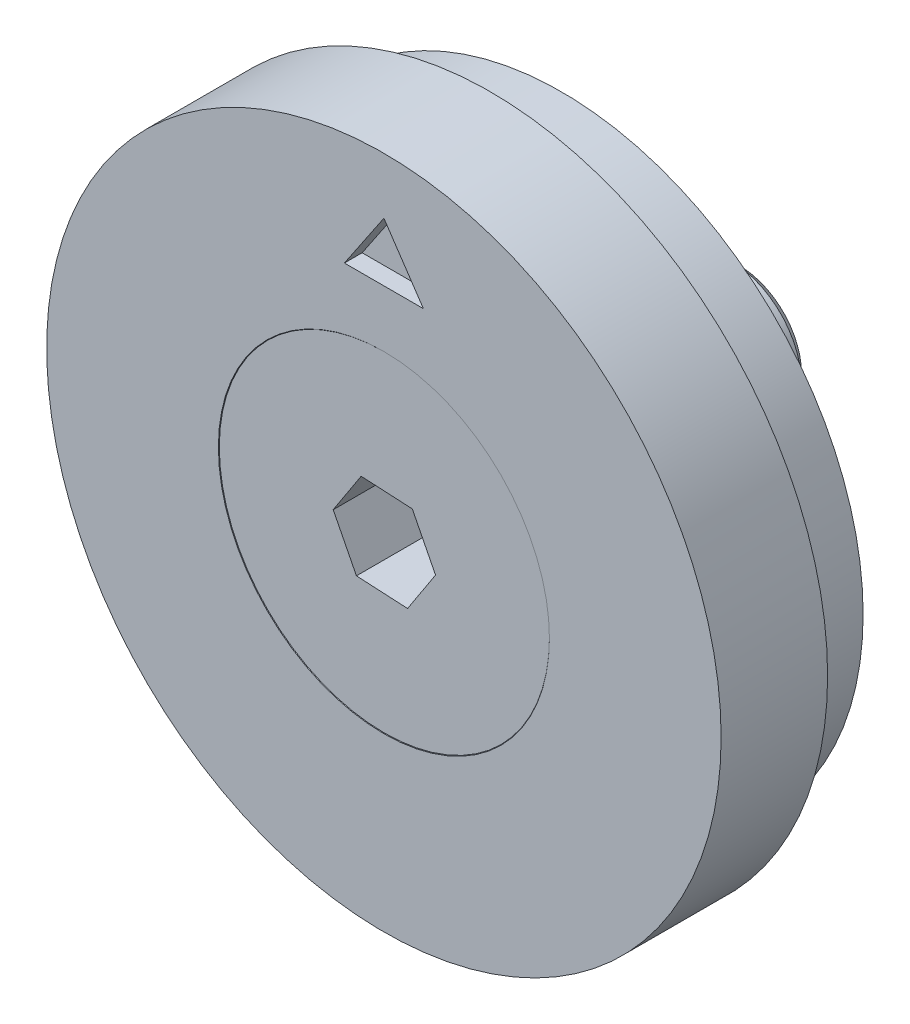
ISO-10303-21;
HEADER;
FILE_DESCRIPTION(('STEP AP214'),'2;1');
FILE_NAME('part.step','',(''),(''),'','','');
FILE_SCHEMA(('AUTOMOTIVE_DESIGN { 1 0 10303 214 1 1 1 1 }'));
ENDSEC;
DATA;
#1=APPLICATION_CONTEXT('core data for automotive mechanical design processes');
#2=APPLICATION_PROTOCOL_DEFINITION('international standard','automotive_design',2000,#1);
#3=PRODUCT_CONTEXT('',#1,'mechanical');
#4=PRODUCT('Part','Part','',(#3));
#5=PRODUCT_RELATED_PRODUCT_CATEGORY('part','',(#4));
#6=PRODUCT_DEFINITION_FORMATION('','',#4);
#7=PRODUCT_DEFINITION_CONTEXT('part definition',#1,'design');
#8=PRODUCT_DEFINITION('design','',#6,#7);
#9=PRODUCT_DEFINITION_SHAPE('','',#8);
#10=(LENGTH_UNIT() NAMED_UNIT(*) SI_UNIT(.MILLI.,.METRE.));
#11=(NAMED_UNIT(*) PLANE_ANGLE_UNIT() SI_UNIT($,.RADIAN.));
#12=(NAMED_UNIT(*) SI_UNIT($,.STERADIAN.) SOLID_ANGLE_UNIT());
#13=UNCERTAINTY_MEASURE_WITH_UNIT(LENGTH_MEASURE(1.E-05),#10,'distance_accuracy_value','');
#14=(GEOMETRIC_REPRESENTATION_CONTEXT(3) GLOBAL_UNCERTAINTY_ASSIGNED_CONTEXT((#13)) GLOBAL_UNIT_ASSIGNED_CONTEXT((#10,
#11,#12)) REPRESENTATION_CONTEXT('',''));
#15=CARTESIAN_POINT('',(0.,0.,0.));
#16=DIRECTION('',(0.,0.,1.));
#17=DIRECTION('',(1.,0.,0.));
#18=AXIS2_PLACEMENT_3D('',#15,#16,#17);
#19=CARTESIAN_POINT('',(0.,0.,-0.0130000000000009));
#20=DIRECTION('',(0.,0.,1.));
#21=DIRECTION('',(1.,0.,0.));
#22=AXIS2_PLACEMENT_3D('',#19,#20,#21);
#23=CYLINDRICAL_SURFACE('',#22,2.);
#24=CARTESIAN_POINT('',(0.,0.,-2.663));
#25=DIRECTION('',(0.,0.,1.));
#26=DIRECTION('',(1.,0.,0.));
#27=AXIS2_PLACEMENT_3D('',#24,#25,#26);
#28=CIRCLE('',#27,2.);
#29=CARTESIAN_POINT('',(2.,0.,-2.663));
#30=VERTEX_POINT('',#29);
#31=EDGE_CURVE('P0_E11',#30,#30,#28,.T.);
#32=ORIENTED_EDGE('',*,*,#31,.F.);
#33=EDGE_LOOP('',(#32));
#34=FACE_BOUND('',#33,.T.);
#35=CARTESIAN_POINT('',(0.,0.,-9.763));
#36=DIRECTION('',(0.,0.,1.));
#37=DIRECTION('',(1.,0.,0.));
#38=AXIS2_PLACEMENT_3D('',#35,#36,#37);
#39=CIRCLE('',#38,2.);
#40=CARTESIAN_POINT('',(2.,0.,-9.763));
#41=VERTEX_POINT('',#40);
#42=EDGE_CURVE('P0_E136',#41,#41,#39,.T.);
#43=ORIENTED_EDGE('',*,*,#42,.T.);
#44=EDGE_LOOP('',(#43));
#45=FACE_BOUND('',#44,.T.);
#46=ADVANCED_FACE('P0_F35',(#34,#45),#23,.T.);
#47=CARTESIAN_POINT('',(0.,0.,-2.663));
#48=DIRECTION('',(0.,0.,1.));
#49=DIRECTION('',(1.,0.,0.));
#50=AXIS2_PLACEMENT_3D('',#47,#48,#49);
#51=CONICAL_SURFACE('',#50,2.,0.785398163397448);
#52=CARTESIAN_POINT('',(0.,0.,-0.0130000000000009));
#53=DIRECTION('',(0.,0.,1.));
#54=DIRECTION('',(1.,0.,0.));
#55=AXIS2_PLACEMENT_3D('',#52,#53,#54);
#56=CIRCLE('',#55,4.65);
#57=CARTESIAN_POINT('',(4.65,0.,-0.0130000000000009));
#58=VERTEX_POINT('',#57);
#59=EDGE_CURVE('P0_E42',#58,#58,#56,.T.);
#60=ORIENTED_EDGE('',*,*,#59,.F.);
#61=EDGE_LOOP('',(#60));
#62=FACE_BOUND('',#61,.T.);
#63=ORIENTED_EDGE('',*,*,#31,.T.);
#64=EDGE_LOOP('',(#63));
#65=FACE_BOUND('',#64,.T.);
#66=ADVANCED_FACE('P0_F151',(#62,#65),#51,.T.);
#67=CARTESIAN_POINT('',(0.,4.65,-0.0130000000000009));
#68=DIRECTION('',(0.,0.,-1.));
#69=DIRECTION('',(-1.,0.,0.));
#70=AXIS2_PLACEMENT_3D('',#67,#68,#69);
#71=PLANE('',#70);
#72=DIRECTION('',(0.99860351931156,-0.0528300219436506,0.));
#73=VECTOR('',#72,1.);
#74=CARTESIAN_POINT('',(-0.786717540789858,-1.21012761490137,-0.0130000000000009));
#75=LINE('',#74,#73);
#76=CARTESIAN_POINT('',(-0.786717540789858,-1.21012761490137,-0.0130000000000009));
#77=VERTEX_POINT('',#76);
#78=CARTESIAN_POINT('',(0.654642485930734,-1.28638118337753,-0.0130000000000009));
#79=VERTEX_POINT('',#78);
#80=EDGE_CURVE('P0_E123',#77,#79,#75,.T.);
#81=ORIENTED_EDGE('',*,*,#80,.F.);
#82=DIRECTION('',(0.453549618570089,-0.891231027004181,0.));
#83=VECTOR('',#82,1.);
#84=CARTESIAN_POINT('',(-1.44136002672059,0.076253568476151,-0.0130000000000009));
#85=LINE('',#84,#83);
#86=CARTESIAN_POINT('',(-1.44136002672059,0.076253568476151,-0.0130000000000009));
#87=VERTEX_POINT('',#86);
#88=EDGE_CURVE('P0_E49',#87,#77,#85,.T.);
#89=ORIENTED_EDGE('',*,*,#88,.F.);
#90=DIRECTION('',(-0.545053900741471,-0.83840100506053,0.));
#91=VECTOR('',#90,1.);
#92=CARTESIAN_POINT('',(-0.654642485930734,1.28638118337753,-0.0130000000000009));
#93=LINE('',#92,#91);
#94=CARTESIAN_POINT('',(-0.654642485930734,1.28638118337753,-0.0130000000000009));
#95=VERTEX_POINT('',#94);
#96=EDGE_CURVE('P0_E132',#95,#87,#93,.T.);
#97=ORIENTED_EDGE('',*,*,#96,.F.);
#98=DIRECTION('',(-0.99860351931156,0.0528300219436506,0.));
#99=VECTOR('',#98,1.);
#100=CARTESIAN_POINT('',(0.786717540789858,1.21012761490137,-0.0130000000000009));
#101=LINE('',#100,#99);
#102=CARTESIAN_POINT('',(0.786717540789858,1.21012761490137,-0.0130000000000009));
#103=VERTEX_POINT('',#102);
#104=EDGE_CURVE('P0_E130',#103,#95,#101,.T.);
#105=ORIENTED_EDGE('',*,*,#104,.F.);
#106=DIRECTION('',(-0.45354961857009,0.891231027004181,0.));
#107=VECTOR('',#106,1.);
#108=CARTESIAN_POINT('',(1.44136002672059,-0.0762535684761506,-0.0130000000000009));
#109=LINE('',#108,#107);
#110=CARTESIAN_POINT('',(1.44136002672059,-0.0762535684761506,-0.0130000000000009));
#111=VERTEX_POINT('',#110);
#112=EDGE_CURVE('P0_E97',#111,#103,#109,.T.);
#113=ORIENTED_EDGE('',*,*,#112,.F.);
#114=DIRECTION('',(0.545053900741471,0.83840100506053,0.));
#115=VECTOR('',#114,1.);
#116=CARTESIAN_POINT('',(0.654642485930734,-1.28638118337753,-0.0130000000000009));
#117=LINE('',#116,#115);
#118=EDGE_CURVE('P0_E126',#79,#111,#117,.T.);
#119=ORIENTED_EDGE('',*,*,#118,.F.);
#120=EDGE_LOOP('',(#81,#89,#97,#105,#113,#119));
#121=FACE_BOUND('',#120,.T.);
#122=ORIENTED_EDGE('',*,*,#59,.T.);
#123=EDGE_LOOP('',(#122));
#124=FACE_BOUND('',#123,.T.);
#125=ADVANCED_FACE('P0_F149',(#121,#124),#71,.F.);
#126=CARTESIAN_POINT('',(0.,0.,-10.013));
#127=DIRECTION('',(0.,0.,1.));
#128=DIRECTION('',(1.,0.,0.));
#129=AXIS2_PLACEMENT_3D('',#126,#127,#128);
#130=PLANE('',#129);
#131=CARTESIAN_POINT('',(0.,0.,-10.013));
#132=DIRECTION('',(0.,0.,1.));
#133=DIRECTION('',(1.,0.,0.));
#134=AXIS2_PLACEMENT_3D('',#131,#132,#133);
#135=CIRCLE('',#134,1.75);
#136=CARTESIAN_POINT('',(1.75,0.,-10.013));
#137=VERTEX_POINT('',#136);
#138=EDGE_CURVE('P0_E144',#137,#137,#135,.T.);
#139=ORIENTED_EDGE('',*,*,#138,.F.);
#140=EDGE_LOOP('',(#139));
#141=FACE_BOUND('',#140,.T.);
#142=ADVANCED_FACE('P0_F164',(#141),#130,.F.);
#143=CARTESIAN_POINT('',(0.,0.,-10.013));
#144=DIRECTION('',(0.,0.,1.));
#145=DIRECTION('',(1.,0.,0.));
#146=AXIS2_PLACEMENT_3D('',#143,#144,#145);
#147=CONICAL_SURFACE('',#146,1.75,0.78539816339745);
#148=ORIENTED_EDGE('',*,*,#42,.F.);
#149=EDGE_LOOP('',(#148));
#150=FACE_BOUND('',#149,.T.);
#151=ORIENTED_EDGE('',*,*,#138,.T.);
#152=EDGE_LOOP('',(#151));
#153=FACE_BOUND('',#152,.T.);
#154=ADVANCED_FACE('P0_F160',(#150,#153),#147,.T.);
#155=CARTESIAN_POINT('',(-1.44136002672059,0.076253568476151,-2.013));
#156=DIRECTION('',(-0.891231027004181,-0.453549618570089,0.));
#157=DIRECTION('',(0.453549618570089,-0.891231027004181,0.));
#158=AXIS2_PLACEMENT_3D('',#155,#156,#157);
#159=PLANE('',#158);
#160=ORIENTED_EDGE('',*,*,#88,.T.);
#161=DIRECTION('',(0.,0.,1.));
#162=VECTOR('',#161,1.);
#163=CARTESIAN_POINT('',(-0.786717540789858,-1.21012761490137,-2.013));
#164=LINE('',#163,#162);
#165=CARTESIAN_POINT('',(-0.786717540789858,-1.21012761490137,-2.013));
#166=VERTEX_POINT('',#165);
#167=EDGE_CURVE('P0_E79',#166,#77,#164,.T.);
#168=ORIENTED_EDGE('',*,*,#167,.F.);
#169=DIRECTION('',(0.453549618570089,-0.891231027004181,0.));
#170=VECTOR('',#169,1.);
#171=CARTESIAN_POINT('',(-1.44136002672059,0.076253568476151,-2.013));
#172=LINE('',#171,#170);
#173=CARTESIAN_POINT('',(-1.44136002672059,0.076253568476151,-2.013));
#174=VERTEX_POINT('',#173);
#175=EDGE_CURVE('P0_E134',#174,#166,#172,.T.);
#176=ORIENTED_EDGE('',*,*,#175,.F.);
#177=DIRECTION('',(0.,0.,1.));
#178=VECTOR('',#177,1.);
#179=CARTESIAN_POINT('',(-1.44136002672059,0.076253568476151,-2.013));
#180=LINE('',#179,#178);
#181=EDGE_CURVE('P0_E57',#174,#87,#180,.T.);
#182=ORIENTED_EDGE('',*,*,#181,.T.);
#183=EDGE_LOOP('',(#160,#168,#176,#182));
#184=FACE_BOUND('',#183,.T.);
#185=ADVANCED_FACE('P0_F163',(#184),#159,.F.);
#186=CARTESIAN_POINT('',(-0.654642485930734,1.28638118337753,-2.013));
#187=DIRECTION('',(-0.83840100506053,0.545053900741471,0.));
#188=DIRECTION('',(-0.54505390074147,-0.83840100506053,0.));
#189=AXIS2_PLACEMENT_3D('',#186,#187,#188);
#190=PLANE('',#189);
#191=ORIENTED_EDGE('',*,*,#96,.T.);
#192=ORIENTED_EDGE('',*,*,#181,.F.);
#193=DIRECTION('',(-0.545053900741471,-0.83840100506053,0.));
#194=VECTOR('',#193,1.);
#195=CARTESIAN_POINT('',(-0.654642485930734,1.28638118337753,-2.013));
#196=LINE('',#195,#194);
#197=CARTESIAN_POINT('',(-0.654642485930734,1.28638118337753,-2.013));
#198=VERTEX_POINT('',#197);
#199=EDGE_CURVE('P0_E109',#198,#174,#196,.T.);
#200=ORIENTED_EDGE('',*,*,#199,.F.);
#201=DIRECTION('',(0.,0.,1.));
#202=VECTOR('',#201,1.);
#203=CARTESIAN_POINT('',(-0.654642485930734,1.28638118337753,-2.013));
#204=LINE('',#203,#202);
#205=EDGE_CURVE('P0_E101',#198,#95,#204,.T.);
#206=ORIENTED_EDGE('',*,*,#205,.T.);
#207=EDGE_LOOP('',(#191,#192,#200,#206));
#208=FACE_BOUND('',#207,.T.);
#209=ADVANCED_FACE('P0_F178',(#208),#190,.F.);
#210=CARTESIAN_POINT('',(0.786717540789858,1.21012761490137,-2.013));
#211=DIRECTION('',(0.0528300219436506,0.99860351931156,0.));
#212=DIRECTION('',(-0.99860351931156,0.0528300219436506,0.));
#213=AXIS2_PLACEMENT_3D('',#210,#211,#212);
#214=PLANE('',#213);
#215=ORIENTED_EDGE('',*,*,#104,.T.);
#216=ORIENTED_EDGE('',*,*,#205,.F.);
#217=DIRECTION('',(-0.99860351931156,0.0528300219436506,0.));
#218=VECTOR('',#217,1.);
#219=CARTESIAN_POINT('',(0.786717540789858,1.21012761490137,-2.013));
#220=LINE('',#219,#218);
#221=CARTESIAN_POINT('',(0.786717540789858,1.21012761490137,-2.013));
#222=VERTEX_POINT('',#221);
#223=EDGE_CURVE('P0_E105',#222,#198,#220,.T.);
#224=ORIENTED_EDGE('',*,*,#223,.F.);
#225=DIRECTION('',(0.,0.,1.));
#226=VECTOR('',#225,1.);
#227=CARTESIAN_POINT('',(0.786717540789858,1.21012761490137,-2.013));
#228=LINE('',#227,#226);
#229=EDGE_CURVE('P0_E90',#222,#103,#228,.T.);
#230=ORIENTED_EDGE('',*,*,#229,.T.);
#231=EDGE_LOOP('',(#215,#216,#224,#230));
#232=FACE_BOUND('',#231,.T.);
#233=ADVANCED_FACE('P0_F106',(#232),#214,.F.);
#234=CARTESIAN_POINT('',(1.44136002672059,-0.0762535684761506,-2.013));
#235=DIRECTION('',(0.89123102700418,0.45354961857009,0.));
#236=DIRECTION('',(-0.45354961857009,0.891231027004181,0.));
#237=AXIS2_PLACEMENT_3D('',#234,#235,#236);
#238=PLANE('',#237);
#239=ORIENTED_EDGE('',*,*,#112,.T.);
#240=ORIENTED_EDGE('',*,*,#229,.F.);
#241=DIRECTION('',(-0.45354961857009,0.891231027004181,0.));
#242=VECTOR('',#241,1.);
#243=CARTESIAN_POINT('',(1.44136002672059,-0.0762535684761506,-2.013));
#244=LINE('',#243,#242);
#245=CARTESIAN_POINT('',(1.44136002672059,-0.0762535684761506,-2.013));
#246=VERTEX_POINT('',#245);
#247=EDGE_CURVE('P0_E94',#246,#222,#244,.T.);
#248=ORIENTED_EDGE('',*,*,#247,.F.);
#249=DIRECTION('',(0.,0.,1.));
#250=VECTOR('',#249,1.);
#251=CARTESIAN_POINT('',(1.44136002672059,-0.0762535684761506,-2.013));
#252=LINE('',#251,#250);
#253=EDGE_CURVE('P0_E102',#246,#111,#252,.T.);
#254=ORIENTED_EDGE('',*,*,#253,.T.);
#255=EDGE_LOOP('',(#239,#240,#248,#254));
#256=FACE_BOUND('',#255,.T.);
#257=ADVANCED_FACE('P0_F92',(#256),#238,.F.);
#258=CARTESIAN_POINT('',(0.654642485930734,-1.28638118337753,-2.013));
#259=DIRECTION('',(0.83840100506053,-0.545053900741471,0.));
#260=DIRECTION('',(0.54505390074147,0.83840100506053,0.));
#261=AXIS2_PLACEMENT_3D('',#258,#259,#260);
#262=PLANE('',#261);
#263=ORIENTED_EDGE('',*,*,#118,.T.);
#264=ORIENTED_EDGE('',*,*,#253,.F.);
#265=DIRECTION('',(0.545053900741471,0.83840100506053,0.));
#266=VECTOR('',#265,1.);
#267=CARTESIAN_POINT('',(0.654642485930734,-1.28638118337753,-2.013));
#268=LINE('',#267,#266);
#269=CARTESIAN_POINT('',(0.654642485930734,-1.28638118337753,-2.013));
#270=VERTEX_POINT('',#269);
#271=EDGE_CURVE('P0_E115',#270,#246,#268,.T.);
#272=ORIENTED_EDGE('',*,*,#271,.F.);
#273=DIRECTION('',(0.,0.,1.));
#274=VECTOR('',#273,1.);
#275=CARTESIAN_POINT('',(0.654642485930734,-1.28638118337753,-2.013));
#276=LINE('',#275,#274);
#277=EDGE_CURVE('P0_E139',#270,#79,#276,.T.);
#278=ORIENTED_EDGE('',*,*,#277,.T.);
#279=EDGE_LOOP('',(#263,#264,#272,#278));
#280=FACE_BOUND('',#279,.T.);
#281=ADVANCED_FACE('P0_F182',(#280),#262,.F.);
#282=CARTESIAN_POINT('',(-0.786717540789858,-1.21012761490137,-2.013));
#283=DIRECTION('',(-0.0528300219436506,-0.99860351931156,0.));
#284=DIRECTION('',(0.99860351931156,-0.0528300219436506,0.));
#285=AXIS2_PLACEMENT_3D('',#282,#283,#284);
#286=PLANE('',#285);
#287=ORIENTED_EDGE('',*,*,#80,.T.);
#288=ORIENTED_EDGE('',*,*,#277,.F.);
#289=DIRECTION('',(0.99860351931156,-0.0528300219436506,0.));
#290=VECTOR('',#289,1.);
#291=CARTESIAN_POINT('',(-0.786717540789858,-1.21012761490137,-2.013));
#292=LINE('',#291,#290);
#293=EDGE_CURVE('P0_E117',#166,#270,#292,.T.);
#294=ORIENTED_EDGE('',*,*,#293,.F.);
#295=ORIENTED_EDGE('',*,*,#167,.T.);
#296=EDGE_LOOP('',(#287,#288,#294,#295));
#297=FACE_BOUND('',#296,.T.);
#298=ADVANCED_FACE('P0_F179',(#297),#286,.F.);
#299=CARTESIAN_POINT('',(0.,0.,-2.013));
#300=DIRECTION('',(0.,0.,1.));
#301=DIRECTION('',(1.,0.,0.));
#302=AXIS2_PLACEMENT_3D('',#299,#300,#301);
#303=PLANE('',#302);
#304=ORIENTED_EDGE('',*,*,#175,.T.);
#305=ORIENTED_EDGE('',*,*,#293,.T.);
#306=ORIENTED_EDGE('',*,*,#271,.T.);
#307=ORIENTED_EDGE('',*,*,#247,.T.);
#308=ORIENTED_EDGE('',*,*,#223,.T.);
#309=ORIENTED_EDGE('',*,*,#199,.T.);
#310=EDGE_LOOP('',(#304,#305,#306,#307,#308,#309));
#311=FACE_BOUND('',#310,.T.);
#312=ADVANCED_FACE('P0_F112',(#311),#303,.T.);
#313=CLOSED_SHELL('',(#46,#66,#125,#142,#154,#185,#209,#233,#257,#281,#298,#312));
#314=MANIFOLD_SOLID_BREP('P0_B2',#313);
#315=CARTESIAN_POINT('',(0.,0.,3.12219627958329));
#316=DIRECTION('',(0.,0.,1.));
#317=DIRECTION('',(1.,0.,0.));
#318=AXIS2_PLACEMENT_3D('',#315,#316,#317);
#319=CYLINDRICAL_SURFACE('',#318,9.5);
#320=CARTESIAN_POINT('',(0.,0.,0.));
#321=DIRECTION('',(0.,0.,1.));
#322=DIRECTION('',(1.,0.,0.));
#323=AXIS2_PLACEMENT_3D('',#320,#321,#322);
#324=CIRCLE('',#323,9.5);
#325=CARTESIAN_POINT('',(9.5,0.,0.));
#326=VERTEX_POINT('',#325);
#327=EDGE_CURVE('P1_E11',#326,#326,#324,.T.);
#328=ORIENTED_EDGE('',*,*,#327,.F.);
#329=EDGE_LOOP('',(#328));
#330=FACE_BOUND('',#329,.T.);
#331=CARTESIAN_POINT('',(0.,0.,-3.));
#332=DIRECTION('',(0.,0.,1.));
#333=DIRECTION('',(1.,0.,0.));
#334=AXIS2_PLACEMENT_3D('',#331,#332,#333);
#335=CIRCLE('',#334,9.5);
#336=CARTESIAN_POINT('',(9.5,0.,-3.));
#337=VERTEX_POINT('',#336);
#338=EDGE_CURVE('P1_E75',#337,#337,#335,.T.);
#339=ORIENTED_EDGE('',*,*,#338,.T.);
#340=EDGE_LOOP('',(#339));
#341=FACE_BOUND('',#340,.T.);
#342=ADVANCED_FACE('P1_F16',(#330,#341),#319,.T.);
#343=CARTESIAN_POINT('',(0.,9.5,0.));
#344=DIRECTION('',(0.,0.,-1.));
#345=DIRECTION('',(-1.,0.,0.));
#346=AXIS2_PLACEMENT_3D('',#343,#344,#345);
#347=PLANE('',#346);
#348=DIRECTION('',(-0.559192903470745,0.829037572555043,0.));
#349=VECTOR('',#348,1.);
#350=CARTESIAN_POINT('',(1.11293905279,6.264516,0.));
#351=LINE('',#350,#349);
#352=CARTESIAN_POINT('',(1.11293905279,6.264516,0.));
#353=VERTEX_POINT('',#352);
#354=CARTESIAN_POINT('',(0.,7.914516,0.));
#355=VERTEX_POINT('',#354);
#356=EDGE_CURVE('P1_E68',#353,#355,#351,.T.);
#357=ORIENTED_EDGE('',*,*,#356,.F.);
#358=DIRECTION('',(1.,0.,0.));
#359=VECTOR('',#358,1.);
#360=CARTESIAN_POINT('',(-1.11293905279,6.264516,0.));
#361=LINE('',#360,#359);
#362=CARTESIAN_POINT('',(-1.11293905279,6.264516,0.));
#363=VERTEX_POINT('',#362);
#364=EDGE_CURVE('P1_E30',#363,#353,#361,.T.);
#365=ORIENTED_EDGE('',*,*,#364,.F.);
#366=DIRECTION('',(-0.559192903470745,-0.829037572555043,0.));
#367=VECTOR('',#366,1.);
#368=CARTESIAN_POINT('',(0.,7.914516,0.));
#369=LINE('',#368,#367);
#370=EDGE_CURVE('P1_E66',#355,#363,#369,.T.);
#371=ORIENTED_EDGE('',*,*,#370,.F.);
#372=EDGE_LOOP('',(#357,#365,#371));
#373=FACE_BOUND('',#372,.T.);
#374=CARTESIAN_POINT('',(0.,0.,0.));
#375=DIRECTION('',(0.,0.,1.));
#376=DIRECTION('',(1.,0.,0.));
#377=AXIS2_PLACEMENT_3D('',#374,#375,#376);
#378=CIRCLE('',#377,4.663);
#379=CARTESIAN_POINT('',(4.663,0.,0.));
#380=VERTEX_POINT('',#379);
#381=EDGE_CURVE('P1_E23',#380,#380,#378,.T.);
#382=ORIENTED_EDGE('',*,*,#381,.F.);
#383=EDGE_LOOP('',(#382));
#384=FACE_BOUND('',#383,.T.);
#385=ORIENTED_EDGE('',*,*,#327,.T.);
#386=EDGE_LOOP('',(#385));
#387=FACE_BOUND('',#386,.T.);
#388=ADVANCED_FACE('P1_F95',(#373,#384,#387),#347,.F.);
#389=CARTESIAN_POINT('',(0.,0.,0.));
#390=DIRECTION('',(0.,0.,1.));
#391=DIRECTION('',(1.,0.,0.));
#392=AXIS2_PLACEMENT_3D('',#389,#390,#391);
#393=CONICAL_SURFACE('',#392,4.663,0.785398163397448);
#394=CARTESIAN_POINT('',(0.,0.,-2.663));
#395=DIRECTION('',(0.,0.,1.));
#396=DIRECTION('',(1.,0.,0.));
#397=AXIS2_PLACEMENT_3D('',#394,#395,#396);
#398=CIRCLE('',#397,2.);
#399=CARTESIAN_POINT('',(2.,0.,-2.663));
#400=VERTEX_POINT('',#399);
#401=EDGE_CURVE('P1_E88',#400,#400,#398,.T.);
#402=ORIENTED_EDGE('',*,*,#401,.F.);
#403=EDGE_LOOP('',(#402));
#404=FACE_BOUND('',#403,.T.);
#405=ORIENTED_EDGE('',*,*,#381,.T.);
#406=EDGE_LOOP('',(#405));
#407=FACE_BOUND('',#406,.T.);
#408=ADVANCED_FACE('P1_F93',(#404,#407),#393,.F.);
#409=CARTESIAN_POINT('',(0.,0.,3.12219627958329));
#410=DIRECTION('',(0.,0.,1.));
#411=DIRECTION('',(1.,0.,0.));
#412=AXIS2_PLACEMENT_3D('',#409,#410,#411);
#413=CYLINDRICAL_SURFACE('',#412,2.);
#414=CARTESIAN_POINT('',(0.,0.,-5.));
#415=DIRECTION('',(0.,0.,1.));
#416=DIRECTION('',(1.,0.,0.));
#417=AXIS2_PLACEMENT_3D('',#414,#415,#416);
#418=CIRCLE('',#417,2.);
#419=CARTESIAN_POINT('',(2.,0.,-5.));
#420=VERTEX_POINT('',#419);
#421=EDGE_CURVE('P1_E85',#420,#420,#418,.T.);
#422=ORIENTED_EDGE('',*,*,#421,.F.);
#423=EDGE_LOOP('',(#422));
#424=FACE_BOUND('',#423,.T.);
#425=ORIENTED_EDGE('',*,*,#401,.T.);
#426=EDGE_LOOP('',(#425));
#427=FACE_BOUND('',#426,.T.);
#428=ADVANCED_FACE('P1_F120',(#424,#427),#413,.F.);
#429=CARTESIAN_POINT('',(0.,2.,-5.));
#430=DIRECTION('',(0.,0.,1.));
#431=DIRECTION('',(1.,0.,0.));
#432=AXIS2_PLACEMENT_3D('',#429,#430,#431);
#433=PLANE('',#432);
#434=CARTESIAN_POINT('',(0.,0.,-5.));
#435=DIRECTION('',(0.,0.,1.));
#436=DIRECTION('',(1.,0.,0.));
#437=AXIS2_PLACEMENT_3D('',#434,#435,#436);
#438=CIRCLE('',#437,8.5);
#439=CARTESIAN_POINT('',(8.5,0.,-5.));
#440=VERTEX_POINT('',#439);
#441=EDGE_CURVE('P1_E82',#440,#440,#438,.T.);
#442=ORIENTED_EDGE('',*,*,#441,.F.);
#443=EDGE_LOOP('',(#442));
#444=FACE_BOUND('',#443,.T.);
#445=ORIENTED_EDGE('',*,*,#421,.T.);
#446=EDGE_LOOP('',(#445));
#447=FACE_BOUND('',#446,.T.);
#448=ADVANCED_FACE('P1_F114',(#444,#447),#433,.F.);
#449=CARTESIAN_POINT('',(0.,0.,3.12219627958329));
#450=DIRECTION('',(0.,0.,1.));
#451=DIRECTION('',(1.,0.,0.));
#452=AXIS2_PLACEMENT_3D('',#449,#450,#451);
#453=CYLINDRICAL_SURFACE('',#452,8.5);
#454=CARTESIAN_POINT('',(0.,0.,-3.));
#455=DIRECTION('',(0.,0.,1.));
#456=DIRECTION('',(1.,0.,0.));
#457=AXIS2_PLACEMENT_3D('',#454,#455,#456);
#458=CIRCLE('',#457,8.5);
#459=CARTESIAN_POINT('',(8.5,0.,-3.));
#460=VERTEX_POINT('',#459);
#461=EDGE_CURVE('P1_E79',#460,#460,#458,.T.);
#462=ORIENTED_EDGE('',*,*,#461,.F.);
#463=EDGE_LOOP('',(#462));
#464=FACE_BOUND('',#463,.T.);
#465=ORIENTED_EDGE('',*,*,#441,.T.);
#466=EDGE_LOOP('',(#465));
#467=FACE_BOUND('',#466,.T.);
#468=ADVANCED_FACE('P1_F108',(#464,#467),#453,.T.);
#469=CARTESIAN_POINT('',(0.,8.5,-3.));
#470=DIRECTION('',(0.,0.,1.));
#471=DIRECTION('',(1.,0.,0.));
#472=AXIS2_PLACEMENT_3D('',#469,#470,#471);
#473=PLANE('',#472);
#474=ORIENTED_EDGE('',*,*,#338,.F.);
#475=EDGE_LOOP('',(#474));
#476=FACE_BOUND('',#475,.T.);
#477=ORIENTED_EDGE('',*,*,#461,.T.);
#478=EDGE_LOOP('',(#477));
#479=FACE_BOUND('',#478,.T.);
#480=ADVANCED_FACE('P1_F105',(#476,#479),#473,.F.);
#481=CARTESIAN_POINT('',(-1.11293905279,6.264516,-0.5));
#482=DIRECTION('',(0.,-1.,0.));
#483=DIRECTION('',(0.,0.,-1.));
#484=AXIS2_PLACEMENT_3D('',#481,#482,#483);
#485=PLANE('',#484);
#486=ORIENTED_EDGE('',*,*,#364,.T.);
#487=DIRECTION('',(0.,0.,1.));
#488=VECTOR('',#487,1.);
#489=CARTESIAN_POINT('',(1.11293905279,6.264516,-0.5));
#490=LINE('',#489,#488);
#491=CARTESIAN_POINT('',(1.11293905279,6.264516,-0.5));
#492=VERTEX_POINT('',#491);
#493=EDGE_CURVE('P1_E48',#492,#353,#490,.T.);
#494=ORIENTED_EDGE('',*,*,#493,.F.);
#495=DIRECTION('',(1.,0.,0.));
#496=VECTOR('',#495,1.);
#497=CARTESIAN_POINT('',(-1.11293905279,6.264516,-0.5));
#498=LINE('',#497,#496);
#499=CARTESIAN_POINT('',(-1.11293905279,6.264516,-0.5));
#500=VERTEX_POINT('',#499);
#501=EDGE_CURVE('P1_E52',#500,#492,#498,.T.);
#502=ORIENTED_EDGE('',*,*,#501,.F.);
#503=DIRECTION('',(0.,0.,1.));
#504=VECTOR('',#503,1.);
#505=CARTESIAN_POINT('',(-1.11293905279,6.264516,-0.5));
#506=LINE('',#505,#504);
#507=EDGE_CURVE('P1_E38',#500,#363,#506,.T.);
#508=ORIENTED_EDGE('',*,*,#507,.T.);
#509=EDGE_LOOP('',(#486,#494,#502,#508));
#510=FACE_BOUND('',#509,.T.);
#511=ADVANCED_FACE('P1_F50',(#510),#485,.F.);
#512=CARTESIAN_POINT('',(0.,7.914516,-0.5));
#513=DIRECTION('',(-0.829037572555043,0.559192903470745,0.));
#514=DIRECTION('',(-0.559192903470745,-0.829037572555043,0.));
#515=AXIS2_PLACEMENT_3D('',#512,#513,#514);
#516=PLANE('',#515);
#517=ORIENTED_EDGE('',*,*,#370,.T.);
#518=ORIENTED_EDGE('',*,*,#507,.F.);
#519=DIRECTION('',(-0.559192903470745,-0.829037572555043,0.));
#520=VECTOR('',#519,1.);
#521=CARTESIAN_POINT('',(0.,7.914516,-0.5));
#522=LINE('',#521,#520);
#523=CARTESIAN_POINT('',(0.,7.914516,-0.5));
#524=VERTEX_POINT('',#523);
#525=EDGE_CURVE('P1_E58',#524,#500,#522,.T.);
#526=ORIENTED_EDGE('',*,*,#525,.F.);
#527=DIRECTION('',(0.,0.,1.));
#528=VECTOR('',#527,1.);
#529=CARTESIAN_POINT('',(0.,7.914516,-0.5));
#530=LINE('',#529,#528);
#531=EDGE_CURVE('P1_E57',#524,#355,#530,.T.);
#532=ORIENTED_EDGE('',*,*,#531,.T.);
#533=EDGE_LOOP('',(#517,#518,#526,#532));
#534=FACE_BOUND('',#533,.T.);
#535=ADVANCED_FACE('P1_F138',(#534),#516,.F.);
#536=CARTESIAN_POINT('',(1.11293905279,6.264516,-0.5));
#537=DIRECTION('',(0.829037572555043,0.559192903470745,0.));
#538=DIRECTION('',(-0.559192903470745,0.829037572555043,0.));
#539=AXIS2_PLACEMENT_3D('',#536,#537,#538);
#540=PLANE('',#539);
#541=ORIENTED_EDGE('',*,*,#356,.T.);
#542=ORIENTED_EDGE('',*,*,#531,.F.);
#543=DIRECTION('',(-0.559192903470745,0.829037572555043,0.));
#544=VECTOR('',#543,1.);
#545=CARTESIAN_POINT('',(1.11293905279,6.264516,-0.5));
#546=LINE('',#545,#544);
#547=EDGE_CURVE('P1_E61',#492,#524,#546,.T.);
#548=ORIENTED_EDGE('',*,*,#547,.F.);
#549=ORIENTED_EDGE('',*,*,#493,.T.);
#550=EDGE_LOOP('',(#541,#542,#548,#549));
#551=FACE_BOUND('',#550,.T.);
#552=ADVANCED_FACE('P1_F62',(#551),#540,.F.);
#553=CARTESIAN_POINT('',(1.11293905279,6.264516,-0.5));
#554=DIRECTION('',(0.,0.,1.));
#555=DIRECTION('',(1.,0.,0.));
#556=AXIS2_PLACEMENT_3D('',#553,#554,#555);
#557=PLANE('',#556);
#558=ORIENTED_EDGE('',*,*,#501,.T.);
#559=ORIENTED_EDGE('',*,*,#547,.T.);
#560=ORIENTED_EDGE('',*,*,#525,.T.);
#561=EDGE_LOOP('',(#558,#559,#560));
#562=FACE_BOUND('',#561,.T.);
#563=ADVANCED_FACE('P1_F65',(#562),#557,.T.);
#564=CLOSED_SHELL('',(#342,#388,#408,#428,#448,#468,#480,#511,#535,#552,#563));
#565=MANIFOLD_SOLID_BREP('P1_B1',#564);
#566=ADVANCED_BREP_SHAPE_REPRESENTATION('',(#18,#314,#565),#14);
#567=SHAPE_DEFINITION_REPRESENTATION(#9,#566);
ENDSEC;
END-ISO-10303-21;
